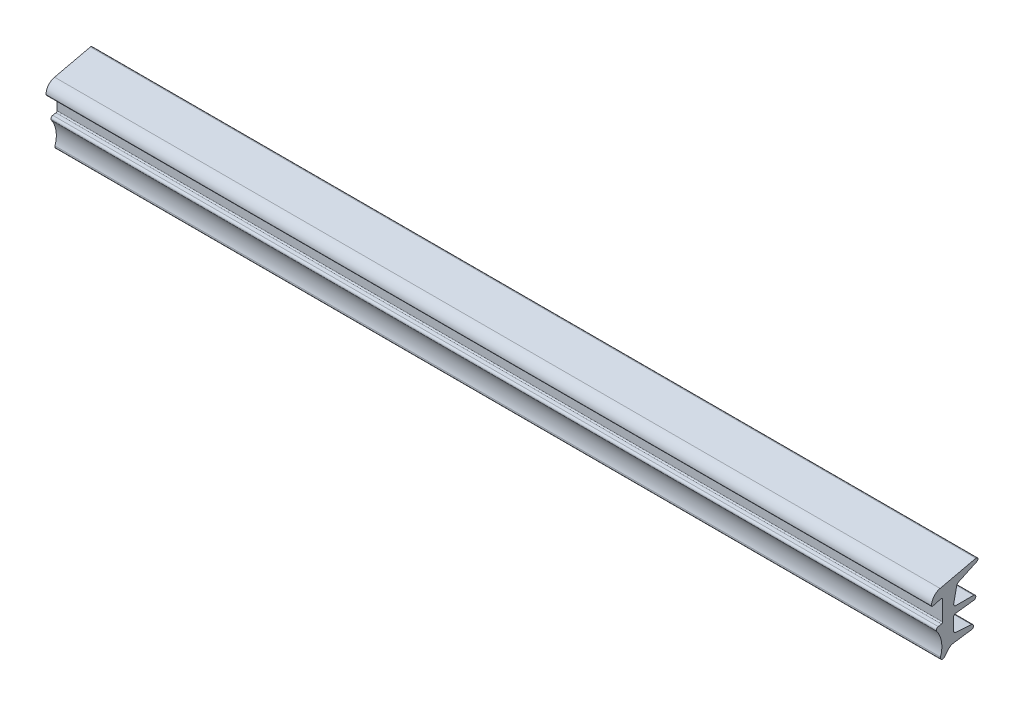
from build123d import *

# Parameters (mm, degrees)
PANEELITIIVISTEET_1_6019_PANEELITIIVISTE_DEPTH = 200


with BuildPart() as part:
    # Sketch1 → Paneelitiivisteet 1.6019 PANEELITIIVISTE (new body)
    with BuildSketch(Plane(origin=(0, 0, 0), x_dir=(0, 0, -1), z_dir=(1, 0, 0))):
        with BuildLine():
            Line((2.379300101, 4.759101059), (6.434873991, 6.650246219))
            ThreePointArc((6.434873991, 6.650246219), (6.644034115, 7.142996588), (6.175846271, 7.402517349))
            Line((6.175846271, 7.402517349), (-1.896550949, 5.538857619))
            ThreePointArc((-1.896550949, 5.538857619), (-3.290693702, 4.659219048), (-3.834173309, 3.102932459))
            Line((-3.834173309, 3.102932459), (-3.834173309, 3.094509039))
            ThreePointArc((-3.834173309, 3.094509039), (-3.755925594, 2.935838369), (-3.582409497, 2.901323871))
            Line((-3.582409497, 2.901323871), (-1.711819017, 3.402547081))
            ThreePointArc((-1.711819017, 3.402547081), (-1.451544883, 3.350775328), (-1.334173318, 3.11276933))
            Line((-1.334173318, 3.11276933), (-1.334173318, -1.28723068))
            ThreePointArc((-1.334173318, -1.28723068), (-1.404359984, -1.480066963), (-1.582078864, -1.582673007))
            Line((-1.582078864, -1.582673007), (-2.32099741, -1.712964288))
            ThreePointArc((-2.32099741, -1.712964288), (-2.696113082, -2.014026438), (-2.643749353, -2.492156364))
            Line((-2.643749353, -2.492156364), (-2.583751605, -2.577842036))
            ThreePointArc((-2.583751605, -2.577842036), (-1.560379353, -5.160943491), (-1.81039038, -7.928107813))
            ThreePointArc((-1.81039038, -7.928107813), (-1.580913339, -8.523357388), (-0.953364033, -8.408624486))
            Line((-0.953364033, -8.408624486), (-0.061322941, -7.345531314))
            ThreePointArc((-0.061322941, -7.345531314), (0.50114669, -6.881867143), (1.192419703, -6.650570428))
            Line((1.192419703, -6.650570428), (5.23541322, -6.082364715))
            ThreePointArc((5.23541322, -6.082364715), (5.665522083, -5.569780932), (5.200704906, -5.088448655))
            Line((5.200704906, -5.088448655), (1.630948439, -4.838826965))
            ThreePointArc((1.630948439, -4.838826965), (1.300149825, -4.681044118), (1.165826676, -4.340044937))
            Line((1.165826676, -4.340044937), (1.165826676, -1.585878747))
            ThreePointArc((1.165826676, -1.585878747), (1.291348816, -1.254568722), (1.604892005, -1.08960567))
            Line((1.604892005, -1.08960567), (5.726761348, -0.583503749))
            ThreePointArc((5.726761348, -0.583503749), (6.16489408, -0.056706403), (5.665826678, 0.412769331))
            Line((5.665826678, 0.412769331), (1.665826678, 0.412769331))
            ThreePointArc((1.665826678, 0.412769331), (1.277253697, 0.598109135), (1.176752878, 1.016725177))
            Line((1.176752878, 1.016725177), (1.823770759, 4.060704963))
            ThreePointArc((1.823770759, 4.060704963), (2.019310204, 4.475307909), (2.379300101, 4.759101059))
        make_face()
    extrude(amount=PANEELITIIVISTEET_1_6019_PANEELITIIVISTE_DEPTH)


solid = part.part
